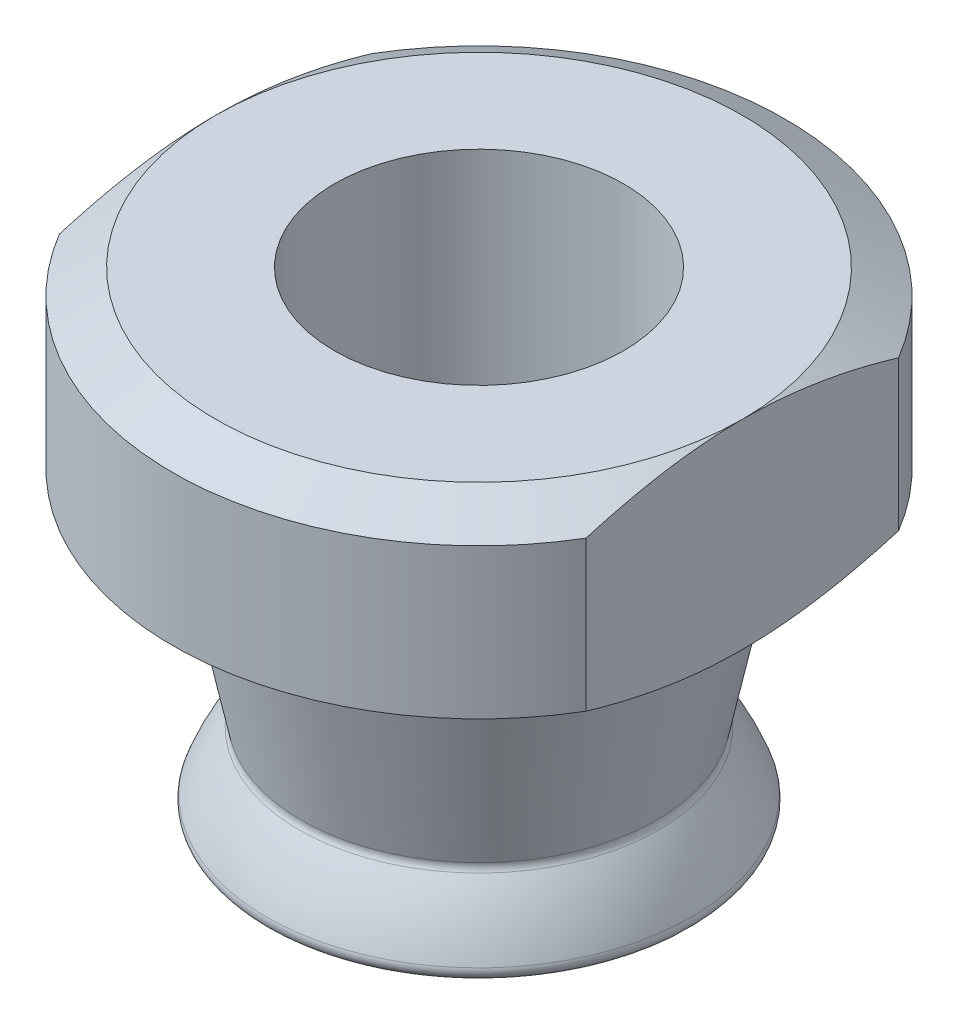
ISO-10303-21;
HEADER;
FILE_DESCRIPTION(('STEP AP214'),'2;1');
FILE_NAME('part.step','',(''),(''),'','','');
FILE_SCHEMA(('AUTOMOTIVE_DESIGN { 1 0 10303 214 1 1 1 1 }'));
ENDSEC;
DATA;
#1=APPLICATION_CONTEXT('core data for automotive mechanical design processes');
#2=APPLICATION_PROTOCOL_DEFINITION('international standard','automotive_design',2000,#1);
#3=PRODUCT_CONTEXT('',#1,'mechanical');
#4=PRODUCT('Part','Part','',(#3));
#5=PRODUCT_RELATED_PRODUCT_CATEGORY('part','',(#4));
#6=PRODUCT_DEFINITION_FORMATION('','',#4);
#7=PRODUCT_DEFINITION_CONTEXT('part definition',#1,'design');
#8=PRODUCT_DEFINITION('design','',#6,#7);
#9=PRODUCT_DEFINITION_SHAPE('','',#8);
#10=(LENGTH_UNIT() NAMED_UNIT(*) SI_UNIT(.MILLI.,.METRE.));
#11=(NAMED_UNIT(*) PLANE_ANGLE_UNIT() SI_UNIT($,.RADIAN.));
#12=(NAMED_UNIT(*) SI_UNIT($,.STERADIAN.) SOLID_ANGLE_UNIT());
#13=UNCERTAINTY_MEASURE_WITH_UNIT(LENGTH_MEASURE(1.E-05),#10,'distance_accuracy_value','');
#14=(GEOMETRIC_REPRESENTATION_CONTEXT(3) GLOBAL_UNCERTAINTY_ASSIGNED_CONTEXT((#13)) GLOBAL_UNIT_ASSIGNED_CONTEXT((#10,
#11,#12)) REPRESENTATION_CONTEXT('',''));
#15=CARTESIAN_POINT('',(0.,0.,0.));
#16=DIRECTION('',(0.,0.,1.));
#17=DIRECTION('',(1.,0.,0.));
#18=AXIS2_PLACEMENT_3D('',#15,#16,#17);
#19=CARTESIAN_POINT('',(0.,7.8270357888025,0.));
#20=DIRECTION('',(0.,-1.,0.));
#21=DIRECTION('',(0.,0.,-1.));
#22=AXIS2_PLACEMENT_3D('',#19,#20,#21);
#23=TOROIDAL_SURFACE('',#22,7.76224,0.39624);
#24=CARTESIAN_POINT('',(0.,7.90727535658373,0.));
#25=DIRECTION('',(0.,-1.,0.));
#26=DIRECTION('',(0.,0.,-1.));
#27=AXIS2_PLACEMENT_3D('',#24,#25,#26);
#28=CIRCLE('',#27,7.37420939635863);
#29=CARTESIAN_POINT('',(0.,7.90727535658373,-7.37420939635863));
#30=VERTEX_POINT('',#29);
#31=EDGE_CURVE('E77',#30,#30,#28,.T.);
#32=ORIENTED_EDGE('',*,*,#31,.T.);
#33=EDGE_LOOP('',(#32));
#34=FACE_BOUND('',#33,.T.);
#35=CARTESIAN_POINT('',(0.,7.5853961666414,0.));
#36=DIRECTION('',(0.,-1.,0.));
#37=DIRECTION('',(0.,0.,-1.));
#38=AXIS2_PLACEMENT_3D('',#35,#36,#37);
#39=CIRCLE('',#38,7.44820746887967);
#40=CARTESIAN_POINT('',(0.,7.5853961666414,-7.44820746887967));
#41=VERTEX_POINT('',#40);
#42=EDGE_CURVE('E29',#41,#41,#39,.T.);
#43=ORIENTED_EDGE('',*,*,#42,.F.);
#44=EDGE_LOOP('',(#43));
#45=FACE_BOUND('',#44,.T.);
#46=ADVANCED_FACE('F14',(#34,#45),#23,.F.);
#47=CARTESIAN_POINT('',(0.,5.0003188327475,0.));
#48=DIRECTION('',(0.,-1.,0.));
#49=DIRECTION('',(0.,0.,-1.));
#50=AXIS2_PLACEMENT_3D('',#47,#48,#49);
#51=TOROIDAL_SURFACE('',#50,8.4340748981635,0.39624);
#52=CARTESIAN_POINT('',(0.,4.60793501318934,0.));
#53=DIRECTION('',(0.,-1.,0.));
#54=DIRECTION('',(0.,0.,-1.));
#55=AXIS2_PLACEMENT_3D('',#52,#53,#54);
#56=CIRCLE('',#55,8.48922084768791);
#57=CARTESIAN_POINT('',(0.,4.60793501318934,-8.48922084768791));
#58=VERTEX_POINT('',#57);
#59=EDGE_CURVE('E116',#58,#58,#56,.T.);
#60=ORIENTED_EDGE('',*,*,#59,.F.);
#61=EDGE_LOOP('',(#60));
#62=FACE_BOUND('',#61,.T.);
#63=CARTESIAN_POINT('',(0.,5.13880487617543,0.));
#64=DIRECTION('',(0.,1.,0.));
#65=DIRECTION('',(0.,0.,-1.));
#66=AXIS2_PLACEMENT_3D('',#63,#64,#65);
#67=CIRCLE('',#66,8.80532650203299);
#68=CARTESIAN_POINT('',(0.,5.13880487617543,-8.80532650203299));
#69=VERTEX_POINT('',#68);
#70=EDGE_CURVE('E213',#69,#69,#67,.T.);
#71=ORIENTED_EDGE('',*,*,#70,.F.);
#72=EDGE_LOOP('',(#71));
#73=FACE_BOUND('',#72,.T.);
#74=ADVANCED_FACE('F174',(#62,#73),#51,.T.);
#75=CARTESIAN_POINT('',(0.,7.90727535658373,0.));
#76=DIRECTION('',(0.,1.,0.));
#77=DIRECTION('',(0.,0.,1.));
#78=AXIS2_PLACEMENT_3D('',#75,#76,#77);
#79=CONICAL_SURFACE('',#78,7.37420939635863,0.203912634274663);
#80=CARTESIAN_POINT('',(0.,14.5542,0.));
#81=DIRECTION('',(0.,-1.,0.));
#82=DIRECTION('',(0.,0.,-1.));
#83=AXIS2_PLACEMENT_3D('',#80,#81,#82);
#84=CIRCLE('',#83,8.74870500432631);
#85=CARTESIAN_POINT('',(0.,14.5542,-8.74870500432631));
#86=VERTEX_POINT('',#85);
#87=EDGE_CURVE('E9',#86,#86,#84,.T.);
#88=ORIENTED_EDGE('',*,*,#87,.T.);
#89=EDGE_LOOP('',(#88));
#90=FACE_BOUND('',#89,.T.);
#91=ORIENTED_EDGE('',*,*,#31,.F.);
#92=EDGE_LOOP('',(#91));
#93=FACE_BOUND('',#92,.T.);
#94=ADVANCED_FACE('F181',(#90,#93),#79,.T.);
#95=CARTESIAN_POINT('',(0.,1.8542,0.));
#96=DIRECTION('',(0.,0.,1.));
#97=DIRECTION('',(1.,0.,0.));
#98=AXIS2_PLACEMENT_3D('',#95,#96,#97);
#99=SPHERICAL_SURFACE('',#98,9.398);
#100=CARTESIAN_POINT('',(0.,1.8542,0.));
#101=DIRECTION('',(0.,1.,0.));
#102=DIRECTION('',(0.,0.,-1.));
#103=AXIS2_PLACEMENT_3D('',#100,#101,#102);
#104=SPHERICAL_SURFACE('',#103,9.398);
#105=ORIENTED_EDGE('',*,*,#70,.T.);
#106=EDGE_LOOP('',(#105));
#107=FACE_BOUND('',#106,.T.);
#108=ORIENTED_EDGE('',*,*,#42,.T.);
#109=EDGE_LOOP('',(#108));
#110=FACE_BOUND('',#109,.T.);
#111=ADVANCED_FACE('F192',(#107,#110),#104,.T.);
#112=CARTESIAN_POINT('',(0.,4.2418,0.));
#113=DIRECTION('',(0.,1.,0.));
#114=DIRECTION('',(0.,0.,1.));
#115=AXIS2_PLACEMENT_3D('',#112,#113,#114);
#116=CONICAL_SURFACE('',#115,5.88403486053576,1.43116998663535);
#117=ORIENTED_EDGE('',*,*,#59,.T.);
#118=EDGE_LOOP('',(#117));
#119=FACE_BOUND('',#118,.T.);
#120=CARTESIAN_POINT('',(0.,4.2418,0.));
#121=DIRECTION('',(0.,-1.,0.));
#122=DIRECTION('',(0.,0.,-1.));
#123=AXIS2_PLACEMENT_3D('',#120,#121,#122);
#124=CIRCLE('',#123,5.88403486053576);
#125=CARTESIAN_POINT('',(0.,4.2418,-5.88403486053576));
#126=VERTEX_POINT('',#125);
#127=EDGE_CURVE('E88',#126,#126,#124,.T.);
#128=ORIENTED_EDGE('',*,*,#127,.F.);
#129=EDGE_LOOP('',(#128));
#130=FACE_BOUND('',#129,.T.);
#131=ADVANCED_FACE('F172',(#119,#130),#116,.T.);
#132=CARTESIAN_POINT('',(0.,23.0526712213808,0.));
#133=DIRECTION('',(0.,-1.,0.));
#134=DIRECTION('',(0.,0.,-1.));
#135=AXIS2_PLACEMENT_3D('',#132,#133,#134);
#136=CONICAL_SURFACE('',#135,12.7,1.0471975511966);
#137=CARTESIAN_POINT('',(0.,24.0792,0.));
#138=DIRECTION('',(0.,-1.,0.));
#139=DIRECTION('',(0.,0.,-1.));
#140=AXIS2_PLACEMENT_3D('',#137,#138,#139);
#141=CIRCLE('',#140,10.922);
#142=CARTESIAN_POINT('',(-10.922,24.0792,0.));
#143=VERTEX_POINT('',#142);
#144=CARTESIAN_POINT('',(10.922,24.0792,0.));
#145=VERTEX_POINT('',#144);
#146=EDGE_CURVE('E114',#143,#145,#141,.T.);
#147=ORIENTED_EDGE('',*,*,#146,.T.);
#148=CARTESIAN_POINT('',(10.922,23.0526712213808,-6.48073421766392));
#149=CARTESIAN_POINT('',(10.922,23.1303365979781,-6.21709667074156));
#150=CARTESIAN_POINT('',(10.922,23.2047969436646,-5.95248860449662));
#151=CARTESIAN_POINT('',(10.922,23.3464451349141,-5.4212638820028));
#152=CARTESIAN_POINT('',(10.922,23.4136310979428,-5.15464672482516));
#153=CARTESIAN_POINT('',(10.922,23.5394924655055,-4.62089140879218));
#154=CARTESIAN_POINT('',(10.922,23.5982111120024,-4.35376351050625));
#155=CARTESIAN_POINT('',(10.922,23.7066497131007,-3.81769636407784));
#156=CARTESIAN_POINT('',(10.922,23.7563702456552,-3.54875723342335));
#157=CARTESIAN_POINT('',(10.922,23.8459956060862,-3.00887454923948));
#158=CARTESIAN_POINT('',(10.922,23.8858874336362,-2.73792882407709));
#159=CARTESIAN_POINT('',(10.922,23.9549738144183,-2.19467675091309));
#160=CARTESIAN_POINT('',(10.922,23.9841686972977,-1.92237044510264));
#161=CARTESIAN_POINT('',(10.922,24.0313252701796,-1.37534736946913));
#162=CARTESIAN_POINT('',(10.922,24.0492275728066,-1.10062543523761));
#163=CARTESIAN_POINT('',(10.922,24.0731913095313,-0.550607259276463));
#164=CARTESIAN_POINT('',(10.922,24.079250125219,-0.275310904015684));
#165=CARTESIAN_POINT('',(10.922,24.0792,0.));
#166=B_SPLINE_CURVE_WITH_KNOTS('',3,(#148,#149,#150,#151,#152,#153,#154,#155,#156,#157,#158,
#159,#160,#161,#162,#163,#164,#165),.UNSPECIFIED.,.F.,.F.,(4,2,2,2,2,2,2,2,4),(0.,
0.824535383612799,1.64928364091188,2.46965827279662,3.28998019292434,4.11138138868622,
4.93275726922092,5.75841749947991,6.58426024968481),.UNSPECIFIED.);
#167=CARTESIAN_POINT('',(10.922,23.0526712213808,-6.48073421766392));
#168=VERTEX_POINT('',#167);
#169=EDGE_CURVE('E97',#168,#145,#166,.T.);
#170=ORIENTED_EDGE('',*,*,#169,.F.);
#171=CARTESIAN_POINT('',(0.,23.0526712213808,0.));
#172=DIRECTION('',(0.,-1.,0.));
#173=DIRECTION('',(0.,0.,-1.));
#174=AXIS2_PLACEMENT_3D('',#171,#172,#173);
#175=CIRCLE('',#174,12.7);
#176=CARTESIAN_POINT('',(-10.922,23.0526712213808,-6.48073421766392));
#177=VERTEX_POINT('',#176);
#178=EDGE_CURVE('E87',#177,#168,#175,.T.);
#179=ORIENTED_EDGE('',*,*,#178,.F.);
#180=CARTESIAN_POINT('',(-10.922,24.0792,0.));
#181=CARTESIAN_POINT('',(-10.922,24.079250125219,-0.275310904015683));
#182=CARTESIAN_POINT('',(-10.922,24.0731913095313,-0.550607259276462));
#183=CARTESIAN_POINT('',(-10.922,24.0492275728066,-1.10062543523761));
#184=CARTESIAN_POINT('',(-10.922,24.0313252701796,-1.37534736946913));
#185=CARTESIAN_POINT('',(-10.922,23.9841686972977,-1.92237044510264));
#186=CARTESIAN_POINT('',(-10.922,23.9549738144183,-2.19467675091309));
#187=CARTESIAN_POINT('',(-10.922,23.8858874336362,-2.73792882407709));
#188=CARTESIAN_POINT('',(-10.922,23.8459956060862,-3.00887454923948));
#189=CARTESIAN_POINT('',(-10.922,23.7563702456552,-3.54875723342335));
#190=CARTESIAN_POINT('',(-10.922,23.7066497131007,-3.81769636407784));
#191=CARTESIAN_POINT('',(-10.922,23.5982111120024,-4.35376351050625));
#192=CARTESIAN_POINT('',(-10.922,23.5394924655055,-4.62089140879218));
#193=CARTESIAN_POINT('',(-10.922,23.4136310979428,-5.15464672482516));
#194=CARTESIAN_POINT('',(-10.922,23.3464451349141,-5.4212638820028));
#195=CARTESIAN_POINT('',(-10.922,23.2047969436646,-5.95248860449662));
#196=CARTESIAN_POINT('',(-10.922,23.1303365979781,-6.21709667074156));
#197=CARTESIAN_POINT('',(-10.922,23.0526712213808,-6.48073421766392));
#198=B_SPLINE_CURVE_WITH_KNOTS('',3,(#180,#181,#182,#183,#184,#185,#186,#187,#188,#189,#190,
#191,#192,#193,#194,#195,#196,#197),.UNSPECIFIED.,.F.,.F.,(4,2,2,2,2,2,2,2,4),(0.,
0.825842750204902,1.65150298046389,2.47287886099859,3.29428005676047,4.1146019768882,
4.93497660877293,5.75972486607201,6.58426024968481),.UNSPECIFIED.);
#199=EDGE_CURVE('E19',#143,#177,#198,.T.);
#200=ORIENTED_EDGE('',*,*,#199,.F.);
#201=EDGE_LOOP('',(#147,#170,#179,#200));
#202=FACE_BOUND('',#201,.T.);
#203=ADVANCED_FACE('F160',(#202),#136,.T.);
#204=CARTESIAN_POINT('',(0.,1.8542,0.));
#205=DIRECTION('',(0.,-1.,0.));
#206=DIRECTION('',(0.,0.,-1.));
#207=AXIS2_PLACEMENT_3D('',#204,#205,#206);
#208=CYLINDRICAL_SURFACE('',#207,12.7);
#209=ORIENTED_EDGE('',*,*,#178,.T.);
#210=DIRECTION('',(0.,1.,0.));
#211=VECTOR('',#210,1.);
#212=CARTESIAN_POINT('',(10.922,1.8542,-6.48073421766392));
#213=LINE('',#212,#211);
#214=CARTESIAN_POINT('',(10.922,16.8354812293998,-6.48073421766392));
#215=VERTEX_POINT('',#214);
#216=EDGE_CURVE('E78',#215,#168,#213,.T.);
#217=ORIENTED_EDGE('',*,*,#216,.F.);
#218=CARTESIAN_POINT('',(0.,16.8354812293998,0.));
#219=DIRECTION('',(0.,-1.,0.));
#220=DIRECTION('',(0.,0.,-1.));
#221=AXIS2_PLACEMENT_3D('',#218,#219,#220);
#222=CIRCLE('',#221,12.7);
#223=CARTESIAN_POINT('',(-10.922,16.8354812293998,-6.48073421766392));
#224=VERTEX_POINT('',#223);
#225=EDGE_CURVE('E72',#224,#215,#222,.T.);
#226=ORIENTED_EDGE('',*,*,#225,.F.);
#227=DIRECTION('',(0.,-1.,0.));
#228=VECTOR('',#227,1.);
#229=CARTESIAN_POINT('',(-10.922,1.8542,-6.48073421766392));
#230=LINE('',#229,#228);
#231=EDGE_CURVE('E108',#177,#224,#230,.T.);
#232=ORIENTED_EDGE('',*,*,#231,.F.);
#233=EDGE_LOOP('',(#209,#217,#226,#232));
#234=FACE_BOUND('',#233,.T.);
#235=ADVANCED_FACE('F163',(#234),#208,.T.);
#236=CARTESIAN_POINT('',(0.,14.5542,0.));
#237=DIRECTION('',(0.,1.,0.));
#238=DIRECTION('',(0.,0.,1.));
#239=AXIS2_PLACEMENT_3D('',#236,#237,#238);
#240=CONICAL_SURFACE('',#239,8.74870500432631,1.0471975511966);
#241=CARTESIAN_POINT('',(0.,16.8354812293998,0.));
#242=DIRECTION('',(0.,-1.,0.));
#243=DIRECTION('',(0.,0.,-1.));
#244=AXIS2_PLACEMENT_3D('',#241,#242,#243);
#245=CIRCLE('',#244,12.7);
#246=CARTESIAN_POINT('',(10.922,16.8354812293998,6.48073421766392));
#247=VERTEX_POINT('',#246);
#248=CARTESIAN_POINT('',(-10.922,16.8354812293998,6.48073421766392));
#249=VERTEX_POINT('',#248);
#250=EDGE_CURVE('E69',#247,#249,#245,.T.);
#251=ORIENTED_EDGE('',*,*,#250,.T.);
#252=CARTESIAN_POINT('',(-10.922,16.8354812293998,-6.48073421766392));
#253=CARTESIAN_POINT('',(-10.922,16.7533860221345,-6.20202970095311));
#254=CARTESIAN_POINT('',(-10.922,16.6748719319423,-5.92228486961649));
#255=CARTESIAN_POINT('',(-10.922,16.5260136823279,-5.36050620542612));
#256=CARTESIAN_POINT('',(-10.922,16.455673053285,-5.07847143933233));
#257=CARTESIAN_POINT('',(-10.922,16.2582300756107,-4.22770433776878));
#258=CARTESIAN_POINT('',(-10.922,16.1450863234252,-3.65556515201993));
#259=CARTESIAN_POINT('',(-10.922,16.0109074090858,-2.79935614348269));
#260=CARTESIAN_POINT('',(-10.922,15.9723870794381,-2.51795884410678));
#261=CARTESIAN_POINT('',(-10.922,15.9070647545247,-1.95377837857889));
#262=CARTESIAN_POINT('',(-10.922,15.8802629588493,-1.67099518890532));
#263=CARTESIAN_POINT('',(-10.922,15.8390645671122,-1.10488181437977));
#264=CARTESIAN_POINT('',(-10.922,15.8246523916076,-0.821552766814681));
#265=CARTESIAN_POINT('',(-10.922,15.8085460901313,-0.254534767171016));
#266=CARTESIAN_POINT('',(-10.922,15.8068516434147,0.0291541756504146));
#267=CARTESIAN_POINT('',(-10.922,15.8158022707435,0.570899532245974));
#268=CARTESIAN_POINT('',(-10.922,15.8253551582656,0.828974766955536));
#269=CARTESIAN_POINT('',(-10.922,15.8548279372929,1.34455149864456));
#270=CARTESIAN_POINT('',(-10.922,15.8747486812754,1.60205294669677));
#271=CARTESIAN_POINT('',(-10.922,15.9245715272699,2.11633394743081));
#272=CARTESIAN_POINT('',(-10.922,15.9544832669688,2.37311256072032));
#273=CARTESIAN_POINT('',(-10.922,16.0237058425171,2.8854101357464));
#274=CARTESIAN_POINT('',(-10.922,16.0630173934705,3.14092900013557));
#275=CARTESIAN_POINT('',(-10.922,16.1960937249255,3.91726867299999));
#276=CARTESIAN_POINT('',(-10.922,16.3037718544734,4.435705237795));
#277=CARTESIAN_POINT('',(-10.922,16.5489219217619,5.46431400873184));
#278=CARTESIAN_POINT('',(-10.922,16.6863263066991,5.97450217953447));
#279=CARTESIAN_POINT('',(-10.922,16.8354812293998,6.48073421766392));
#280=B_SPLINE_CURVE_WITH_KNOTS('',3,(#252,#253,#254,#255,#256,#257,#258,#259,#260,#261,#262,
#263,#264,#265,#266,#267,#268,#269,#270,#271,#272,#273,#274,#275,#276,#277,#278,#279),
.UNSPECIFIED.,.F.,.F.,(4,2,2,2,2,2,2,2,2,2,2,2,2,4),(0.,0.871563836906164,1.74350274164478,
3.49131071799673,4.34317888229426,5.19506155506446,6.04587144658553,6.89665988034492,
7.67120574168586,8.44581529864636,9.22117424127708,9.99659218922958,11.5840259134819,
13.1678894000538),.UNSPECIFIED.);
#281=EDGE_CURVE('E95',#224,#249,#280,.T.);
#282=ORIENTED_EDGE('',*,*,#281,.F.);
#283=ORIENTED_EDGE('',*,*,#225,.T.);
#284=CARTESIAN_POINT('',(10.922,16.8354812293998,6.48073421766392));
#285=CARTESIAN_POINT('',(10.922,16.7533860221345,6.20202970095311));
#286=CARTESIAN_POINT('',(10.922,16.6748719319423,5.92228486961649));
#287=CARTESIAN_POINT('',(10.922,16.5260136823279,5.36050620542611));
#288=CARTESIAN_POINT('',(10.922,16.455673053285,5.07847143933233));
#289=CARTESIAN_POINT('',(10.922,16.2582300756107,4.22770433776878));
#290=CARTESIAN_POINT('',(10.922,16.1450863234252,3.65556515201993));
#291=CARTESIAN_POINT('',(10.922,16.0109074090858,2.79935614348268));
#292=CARTESIAN_POINT('',(10.922,15.9723870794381,2.51795884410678));
#293=CARTESIAN_POINT('',(10.922,15.9070647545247,1.95377837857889));
#294=CARTESIAN_POINT('',(10.922,15.8802629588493,1.67099518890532));
#295=CARTESIAN_POINT('',(10.922,15.8390645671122,1.10488181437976));
#296=CARTESIAN_POINT('',(10.922,15.8246523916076,0.821552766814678));
#297=CARTESIAN_POINT('',(10.922,15.8085460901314,0.254534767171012));
#298=CARTESIAN_POINT('',(10.922,15.8068516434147,-0.0291541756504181));
#299=CARTESIAN_POINT('',(10.922,15.8158022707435,-0.570899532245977));
#300=CARTESIAN_POINT('',(10.922,15.8253551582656,-0.828974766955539));
#301=CARTESIAN_POINT('',(10.922,15.8548279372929,-1.34455149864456));
#302=CARTESIAN_POINT('',(10.922,15.8747486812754,-1.60205294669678));
#303=CARTESIAN_POINT('',(10.922,15.9245715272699,-2.11633394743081));
#304=CARTESIAN_POINT('',(10.922,15.9544832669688,-2.37311256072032));
#305=CARTESIAN_POINT('',(10.922,16.0237058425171,-2.8854101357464));
#306=CARTESIAN_POINT('',(10.922,16.0630173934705,-3.14092900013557));
#307=CARTESIAN_POINT('',(10.922,16.1960937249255,-3.91726867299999));
#308=CARTESIAN_POINT('',(10.922,16.3037718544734,-4.435705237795));
#309=CARTESIAN_POINT('',(10.922,16.5489219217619,-5.46431400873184));
#310=CARTESIAN_POINT('',(10.922,16.6863263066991,-5.97450217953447));
#311=CARTESIAN_POINT('',(10.922,16.8354812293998,-6.48073421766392));
#312=B_SPLINE_CURVE_WITH_KNOTS('',3,(#284,#285,#286,#287,#288,#289,#290,#291,#292,#293,#294,
#295,#296,#297,#298,#299,#300,#301,#302,#303,#304,#305,#306,#307,#308,#309,#310,#311),
.UNSPECIFIED.,.F.,.F.,(4,2,2,2,2,2,2,2,2,2,2,2,2,4),(0.,0.871563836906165,1.74350274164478,
3.49131071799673,4.34317888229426,5.19506155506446,6.04587144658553,6.89665988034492,
7.67120574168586,8.44581529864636,9.22117424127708,9.99659218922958,11.5840259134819,
13.1678894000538),.UNSPECIFIED.);
#313=EDGE_CURVE('E64',#247,#215,#312,.T.);
#314=ORIENTED_EDGE('',*,*,#313,.F.);
#315=EDGE_LOOP('',(#251,#282,#283,#314));
#316=FACE_BOUND('',#315,.T.);
#317=ORIENTED_EDGE('',*,*,#87,.F.);
#318=EDGE_LOOP('',(#317));
#319=FACE_BOUND('',#318,.T.);
#320=ADVANCED_FACE('F66',(#316,#319),#240,.T.);
#321=CARTESIAN_POINT('',(0.,1.8542,0.));
#322=DIRECTION('',(0.,0.,1.));
#323=DIRECTION('',(1.,0.,0.));
#324=AXIS2_PLACEMENT_3D('',#321,#322,#323);
#325=SPHERICAL_SURFACE('',#324,6.35);
#326=CARTESIAN_POINT('',(0.,1.8542,0.));
#327=DIRECTION('',(0.,-1.,0.));
#328=DIRECTION('',(0.,0.,-1.));
#329=AXIS2_PLACEMENT_3D('',#326,#327,#328);
#330=SPHERICAL_SURFACE('',#329,6.35);
#331=ORIENTED_EDGE('',*,*,#127,.T.);
#332=EDGE_LOOP('',(#331));
#333=FACE_BOUND('',#332,.T.);
#334=ADVANCED_FACE('F171',(#333),#330,.F.);
#335=CARTESIAN_POINT('',(0.,1.8542,0.));
#336=DIRECTION('',(0.,-1.,0.));
#337=DIRECTION('',(0.,0.,-1.));
#338=AXIS2_PLACEMENT_3D('',#335,#336,#337);
#339=CYLINDRICAL_SURFACE('',#338,12.7);
#340=DIRECTION('',(0.,1.,0.));
#341=VECTOR('',#340,1.);
#342=CARTESIAN_POINT('',(-10.922,1.8542,6.48073421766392));
#343=LINE('',#342,#341);
#344=CARTESIAN_POINT('',(-10.922,23.0526712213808,6.48073421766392));
#345=VERTEX_POINT('',#344);
#346=EDGE_CURVE('E85',#249,#345,#343,.T.);
#347=ORIENTED_EDGE('',*,*,#346,.F.);
#348=ORIENTED_EDGE('',*,*,#250,.F.);
#349=DIRECTION('',(0.,-1.,0.));
#350=VECTOR('',#349,1.);
#351=CARTESIAN_POINT('',(10.922,1.8542,6.48073421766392));
#352=LINE('',#351,#350);
#353=CARTESIAN_POINT('',(10.922,23.0526712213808,6.48073421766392));
#354=VERTEX_POINT('',#353);
#355=EDGE_CURVE('E83',#354,#247,#352,.T.);
#356=ORIENTED_EDGE('',*,*,#355,.F.);
#357=CARTESIAN_POINT('',(0.,23.0526712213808,0.));
#358=DIRECTION('',(0.,-1.,0.));
#359=DIRECTION('',(0.,0.,-1.));
#360=AXIS2_PLACEMENT_3D('',#357,#358,#359);
#361=CIRCLE('',#360,12.7);
#362=EDGE_CURVE('E106',#354,#345,#361,.T.);
#363=ORIENTED_EDGE('',*,*,#362,.T.);
#364=EDGE_LOOP('',(#347,#348,#356,#363));
#365=FACE_BOUND('',#364,.T.);
#366=ADVANCED_FACE('F81',(#365),#339,.T.);
#367=CARTESIAN_POINT('',(0.,23.0526712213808,0.));
#368=DIRECTION('',(0.,-1.,0.));
#369=DIRECTION('',(0.,0.,-1.));
#370=AXIS2_PLACEMENT_3D('',#367,#368,#369);
#371=CONICAL_SURFACE('',#370,12.7,1.0471975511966);
#372=CARTESIAN_POINT('',(-10.922,23.0526712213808,6.48073421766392));
#373=CARTESIAN_POINT('',(-10.922,23.1303365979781,6.21709667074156));
#374=CARTESIAN_POINT('',(-10.922,23.2047969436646,5.95248860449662));
#375=CARTESIAN_POINT('',(-10.922,23.3464451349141,5.4212638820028));
#376=CARTESIAN_POINT('',(-10.922,23.4136310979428,5.15464672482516));
#377=CARTESIAN_POINT('',(-10.922,23.5394924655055,4.62089140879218));
#378=CARTESIAN_POINT('',(-10.922,23.5982111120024,4.35376351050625));
#379=CARTESIAN_POINT('',(-10.922,23.7066497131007,3.81769636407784));
#380=CARTESIAN_POINT('',(-10.922,23.7563702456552,3.54875723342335));
#381=CARTESIAN_POINT('',(-10.922,23.8459956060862,3.00887454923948));
#382=CARTESIAN_POINT('',(-10.922,23.8858874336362,2.73792882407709));
#383=CARTESIAN_POINT('',(-10.922,23.9549738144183,2.19467675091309));
#384=CARTESIAN_POINT('',(-10.922,23.9841686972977,1.92237044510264));
#385=CARTESIAN_POINT('',(-10.922,24.0313252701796,1.37534736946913));
#386=CARTESIAN_POINT('',(-10.922,24.0492275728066,1.10062543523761));
#387=CARTESIAN_POINT('',(-10.922,24.0731913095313,0.550607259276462));
#388=CARTESIAN_POINT('',(-10.922,24.079250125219,0.275310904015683));
#389=CARTESIAN_POINT('',(-10.922,24.0792,0.));
#390=B_SPLINE_CURVE_WITH_KNOTS('',3,(#372,#373,#374,#375,#376,#377,#378,#379,#380,#381,#382,
#383,#384,#385,#386,#387,#388,#389),.UNSPECIFIED.,.F.,.F.,(4,2,2,2,2,2,2,2,4),(0.,
0.824535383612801,1.64928364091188,2.46965827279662,3.28998019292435,4.11138138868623,
4.93275726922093,5.75841749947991,6.58426024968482),.UNSPECIFIED.);
#391=EDGE_CURVE('E113',#345,#143,#390,.T.);
#392=ORIENTED_EDGE('',*,*,#391,.F.);
#393=ORIENTED_EDGE('',*,*,#362,.F.);
#394=CARTESIAN_POINT('',(10.922,24.0792,0.));
#395=CARTESIAN_POINT('',(10.922,24.079250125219,0.27531090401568));
#396=CARTESIAN_POINT('',(10.922,24.0731913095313,0.550607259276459));
#397=CARTESIAN_POINT('',(10.922,24.0492275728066,1.10062543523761));
#398=CARTESIAN_POINT('',(10.922,24.0313252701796,1.37534736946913));
#399=CARTESIAN_POINT('',(10.922,23.9841686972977,1.92237044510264));
#400=CARTESIAN_POINT('',(10.922,23.9549738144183,2.19467675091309));
#401=CARTESIAN_POINT('',(10.922,23.8858874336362,2.73792882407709));
#402=CARTESIAN_POINT('',(10.922,23.8459956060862,3.00887454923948));
#403=CARTESIAN_POINT('',(10.922,23.7563702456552,3.54875723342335));
#404=CARTESIAN_POINT('',(10.922,23.7066497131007,3.81769636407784));
#405=CARTESIAN_POINT('',(10.922,23.5982111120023,4.35376351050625));
#406=CARTESIAN_POINT('',(10.922,23.5394924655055,4.62089140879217));
#407=CARTESIAN_POINT('',(10.922,23.4136310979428,5.15464672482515));
#408=CARTESIAN_POINT('',(10.922,23.3464451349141,5.4212638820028));
#409=CARTESIAN_POINT('',(10.922,23.2047969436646,5.95248860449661));
#410=CARTESIAN_POINT('',(10.922,23.1303365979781,6.21709667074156));
#411=CARTESIAN_POINT('',(10.922,23.0526712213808,6.48073421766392));
#412=B_SPLINE_CURVE_WITH_KNOTS('',3,(#394,#395,#396,#397,#398,#399,#400,#401,#402,#403,#404,
#405,#406,#407,#408,#409,#410,#411),.UNSPECIFIED.,.F.,.F.,(4,2,2,2,2,2,2,2,4),(0.,
0.825842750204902,1.65150298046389,2.47287886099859,3.29428005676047,4.1146019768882,
4.93497660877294,5.75972486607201,6.58426024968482),.UNSPECIFIED.);
#413=EDGE_CURVE('E94',#145,#354,#412,.T.);
#414=ORIENTED_EDGE('',*,*,#413,.F.);
#415=CARTESIAN_POINT('',(0.,24.0792,0.));
#416=DIRECTION('',(0.,-1.,0.));
#417=DIRECTION('',(0.,0.,-1.));
#418=AXIS2_PLACEMENT_3D('',#415,#416,#417);
#419=CIRCLE('',#418,10.922);
#420=EDGE_CURVE('E103',#145,#143,#419,.T.);
#421=ORIENTED_EDGE('',*,*,#420,.T.);
#422=EDGE_LOOP('',(#392,#393,#414,#421));
#423=FACE_BOUND('',#422,.T.);
#424=ADVANCED_FACE('F145',(#423),#371,.T.);
#425=CARTESIAN_POINT('',(10.922,24.0792,0.));
#426=DIRECTION('',(0.,1.,0.));
#427=DIRECTION('',(0.,0.,1.));
#428=AXIS2_PLACEMENT_3D('',#425,#426,#427);
#429=PLANE('',#428);
#430=CARTESIAN_POINT('',(0.,24.0792,0.));
#431=DIRECTION('',(0.,1.,0.));
#432=DIRECTION('',(0.,0.,1.));
#433=AXIS2_PLACEMENT_3D('',#430,#431,#432);
#434=CIRCLE('',#433,6.);
#435=CARTESIAN_POINT('',(0.,24.0792,6.));
#436=VERTEX_POINT('',#435);
#437=EDGE_CURVE('E218',#436,#436,#434,.T.);
#438=ORIENTED_EDGE('',*,*,#437,.F.);
#439=EDGE_LOOP('',(#438));
#440=FACE_BOUND('',#439,.T.);
#441=ORIENTED_EDGE('',*,*,#420,.F.);
#442=ORIENTED_EDGE('',*,*,#146,.F.);
#443=EDGE_LOOP('',(#441,#442));
#444=FACE_BOUND('',#443,.T.);
#445=ADVANCED_FACE('F133',(#440,#444),#429,.T.);
#446=CARTESIAN_POINT('',(10.922,24.0792,-15.216572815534));
#447=DIRECTION('',(-1.,0.,0.));
#448=DIRECTION('',(0.,0.,1.));
#449=AXIS2_PLACEMENT_3D('',#446,#447,#448);
#450=PLANE('',#449);
#451=ORIENTED_EDGE('',*,*,#313,.T.);
#452=ORIENTED_EDGE('',*,*,#216,.T.);
#453=ORIENTED_EDGE('',*,*,#169,.T.);
#454=ORIENTED_EDGE('',*,*,#413,.T.);
#455=ORIENTED_EDGE('',*,*,#355,.T.);
#456=EDGE_LOOP('',(#451,#452,#453,#454,#455));
#457=FACE_BOUND('',#456,.T.);
#458=ADVANCED_FACE('F91',(#457),#450,.F.);
#459=CARTESIAN_POINT('',(-10.922,24.0792,-15.216572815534));
#460=DIRECTION('',(1.,0.,0.));
#461=DIRECTION('',(0.,0.,-1.));
#462=AXIS2_PLACEMENT_3D('',#459,#460,#461);
#463=PLANE('',#462);
#464=ORIENTED_EDGE('',*,*,#281,.T.);
#465=ORIENTED_EDGE('',*,*,#346,.T.);
#466=ORIENTED_EDGE('',*,*,#391,.T.);
#467=ORIENTED_EDGE('',*,*,#199,.T.);
#468=ORIENTED_EDGE('',*,*,#231,.T.);
#469=EDGE_LOOP('',(#464,#465,#466,#467,#468));
#470=FACE_BOUND('',#469,.T.);
#471=ADVANCED_FACE('F16',(#470),#463,.F.);
#472=CARTESIAN_POINT('',(0.,14.5792,0.));
#473=DIRECTION('',(0.,1.,0.));
#474=DIRECTION('',(0.,0.,1.));
#475=AXIS2_PLACEMENT_3D('',#472,#473,#474);
#476=CYLINDRICAL_SURFACE('',#475,6.);
#477=CARTESIAN_POINT('',(0.,14.5792,0.));
#478=DIRECTION('',(0.,1.,0.));
#479=DIRECTION('',(0.,0.,1.));
#480=AXIS2_PLACEMENT_3D('',#477,#478,#479);
#481=CIRCLE('',#480,6.);
#482=CARTESIAN_POINT('',(0.,14.5792,6.));
#483=VERTEX_POINT('',#482);
#484=EDGE_CURVE('E110',#483,#483,#481,.T.);
#485=ORIENTED_EDGE('',*,*,#484,.F.);
#486=EDGE_LOOP('',(#485));
#487=FACE_BOUND('',#486,.T.);
#488=ORIENTED_EDGE('',*,*,#437,.T.);
#489=EDGE_LOOP('',(#488));
#490=FACE_BOUND('',#489,.T.);
#491=ADVANCED_FACE('F187',(#487,#490),#476,.F.);
#492=CARTESIAN_POINT('',(0.,14.5792,0.));
#493=DIRECTION('',(0.,1.,0.));
#494=DIRECTION('',(0.,0.,1.));
#495=AXIS2_PLACEMENT_3D('',#492,#493,#494);
#496=PLANE('',#495);
#497=ORIENTED_EDGE('',*,*,#484,.T.);
#498=EDGE_LOOP('',(#497));
#499=FACE_BOUND('',#498,.T.);
#500=ADVANCED_FACE('F224',(#499),#496,.T.);
#501=CLOSED_SHELL('',(#46,#74,#94,#111,#131,#203,#235,#320,#334,#366,#424,#445,#458,#471,#491,#500));
#502=MANIFOLD_SOLID_BREP('B1',#501);
#503=ADVANCED_BREP_SHAPE_REPRESENTATION('',(#18,#502),#14);
#504=SHAPE_DEFINITION_REPRESENTATION(#9,#503);
ENDSEC;
END-ISO-10303-21;
